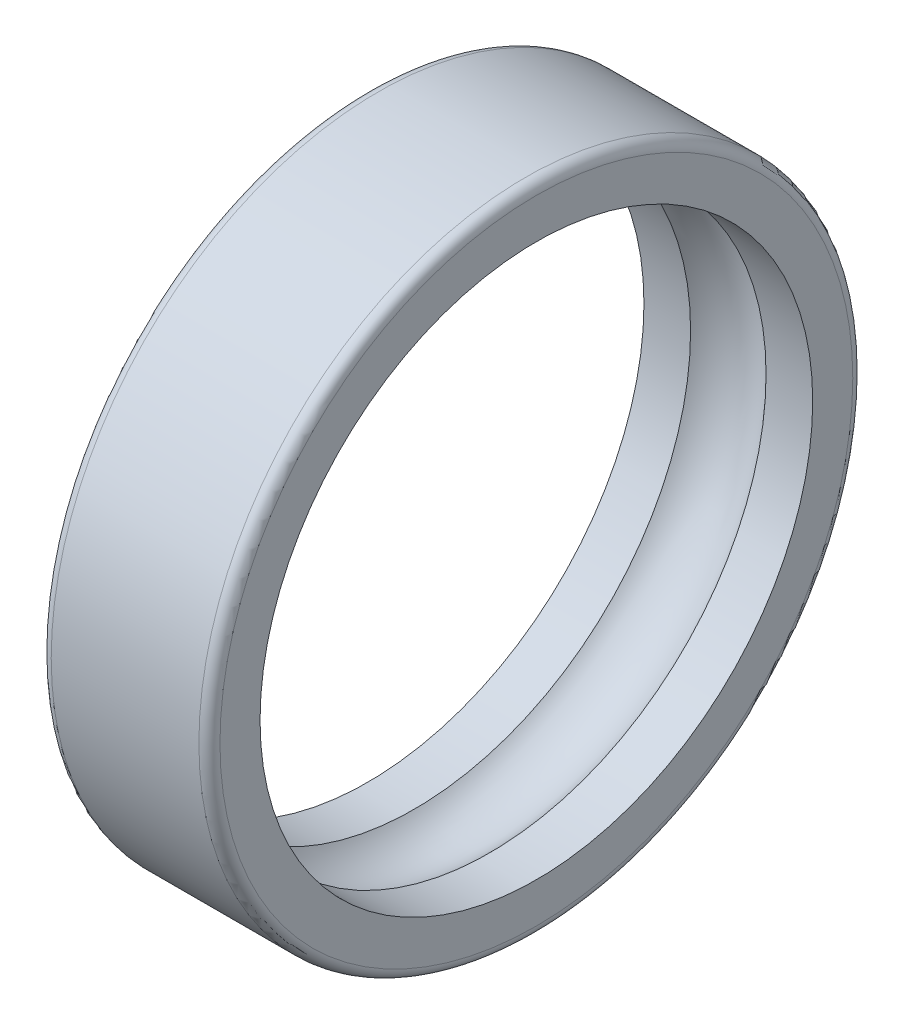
from build123d import *


with BuildPart() as part:
    # Esquisse1 → Base-R_volution (revolve)
    with BuildSketch(Plane(origin=(0, 0, 0), x_dir=(1, 0, 0), z_dir=(0, 1, 0)), mode=Mode.PRIVATE) as base_r_volution_sk:
        with BuildLine():
            Line((0, 30), (0, 26.2))
            Line((0, 26.2), (4.422291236, 26.2))
            ThreePointArc((4.422291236, 26.2), (8, 27.8), (11.577708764, 26.2))
            Line((11.577708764, 26.2), (16, 26.2))
            Line((16, 26.2), (16, 30))
            ThreePointArc((16, 30), (15.707106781, 30.707106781), (15, 31))
            Line((15, 31), (1, 31))
            ThreePointArc((1, 31), (0.292893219, 30.707106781), (0, 30))
        make_face()
    revolve(base_r_volution_sk.sketch.rotate(Axis((0, 0, 0), (1, 0, 0)), 180), axis=Axis((0, 0, 0), (1, 0, 0)))


solid = part.part
